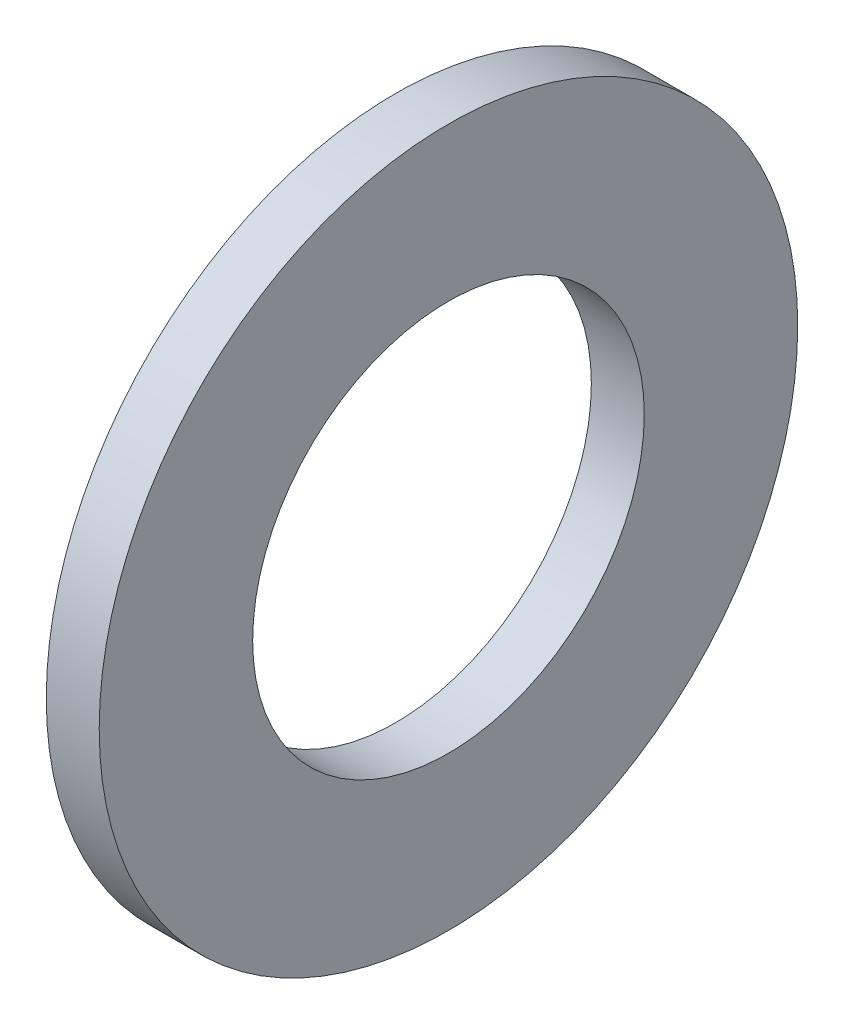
ISO-10303-21;
HEADER;
FILE_DESCRIPTION(('STEP AP214'),'2;1');
FILE_NAME('part.step','',(''),(''),'','','');
FILE_SCHEMA(('AUTOMOTIVE_DESIGN { 1 0 10303 214 1 1 1 1 }'));
ENDSEC;
DATA;
#1=APPLICATION_CONTEXT('core data for automotive mechanical design processes');
#2=APPLICATION_PROTOCOL_DEFINITION('international standard','automotive_design',2000,#1);
#3=PRODUCT_CONTEXT('',#1,'mechanical');
#4=PRODUCT('Part','Part','',(#3));
#5=PRODUCT_RELATED_PRODUCT_CATEGORY('part','',(#4));
#6=PRODUCT_DEFINITION_FORMATION('','',#4);
#7=PRODUCT_DEFINITION_CONTEXT('part definition',#1,'design');
#8=PRODUCT_DEFINITION('design','',#6,#7);
#9=PRODUCT_DEFINITION_SHAPE('','',#8);
#10=(LENGTH_UNIT() NAMED_UNIT(*) SI_UNIT(.MILLI.,.METRE.));
#11=(NAMED_UNIT(*) PLANE_ANGLE_UNIT() SI_UNIT($,.RADIAN.));
#12=(NAMED_UNIT(*) SI_UNIT($,.STERADIAN.) SOLID_ANGLE_UNIT());
#13=UNCERTAINTY_MEASURE_WITH_UNIT(LENGTH_MEASURE(1.E-05),#10,'distance_accuracy_value','');
#14=(GEOMETRIC_REPRESENTATION_CONTEXT(3) GLOBAL_UNCERTAINTY_ASSIGNED_CONTEXT((#13)) GLOBAL_UNIT_ASSIGNED_CONTEXT((#10,
#11,#12)) REPRESENTATION_CONTEXT('',''));
#15=CARTESIAN_POINT('',(0.,0.,0.));
#16=DIRECTION('',(0.,0.,1.));
#17=DIRECTION('',(1.,0.,0.));
#18=AXIS2_PLACEMENT_3D('',#15,#16,#17);
#19=CARTESIAN_POINT('',(-34.9249999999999,0.,0.));
#20=DIRECTION('',(-1.,0.,0.));
#21=DIRECTION('',(0.,0.,1.));
#22=AXIS2_PLACEMENT_3D('',#19,#20,#21);
#23=CYLINDRICAL_SURFACE('',#22,18.5);
#24=CARTESIAN_POINT('',(0.,0.,0.));
#25=DIRECTION('',(-1.,0.,0.));
#26=DIRECTION('',(0.,0.,1.));
#27=AXIS2_PLACEMENT_3D('',#24,#25,#26);
#28=CIRCLE('',#27,18.5);
#29=CARTESIAN_POINT('',(0.,0.,18.5));
#30=VERTEX_POINT('',#29);
#31=EDGE_CURVE('E10',#30,#30,#28,.T.);
#32=ORIENTED_EDGE('',*,*,#31,.F.);
#33=EDGE_LOOP('',(#32));
#34=FACE_BOUND('',#33,.T.);
#35=CARTESIAN_POINT('',(-5.,0.,0.));
#36=DIRECTION('',(-1.,0.,0.));
#37=DIRECTION('',(0.,0.,1.));
#38=AXIS2_PLACEMENT_3D('',#35,#36,#37);
#39=CIRCLE('',#38,18.5);
#40=CARTESIAN_POINT('',(-5.,0.,18.5));
#41=VERTEX_POINT('',#40);
#42=EDGE_CURVE('E44',#41,#41,#39,.T.);
#43=ORIENTED_EDGE('',*,*,#42,.T.);
#44=EDGE_LOOP('',(#43));
#45=FACE_BOUND('',#44,.T.);
#46=ADVANCED_FACE('F30',(#34,#45),#23,.F.);
#47=CARTESIAN_POINT('',(0.,18.5,0.));
#48=DIRECTION('',(-1.,0.,0.));
#49=DIRECTION('',(0.,0.,1.));
#50=AXIS2_PLACEMENT_3D('',#47,#48,#49);
#51=PLANE('',#50);
#52=CARTESIAN_POINT('',(0.,0.,0.));
#53=DIRECTION('',(-1.,0.,0.));
#54=DIRECTION('',(0.,0.,1.));
#55=AXIS2_PLACEMENT_3D('',#52,#53,#54);
#56=CIRCLE('',#55,33.);
#57=CARTESIAN_POINT('',(0.,0.,33.));
#58=VERTEX_POINT('',#57);
#59=EDGE_CURVE('E36',#58,#58,#56,.T.);
#60=ORIENTED_EDGE('',*,*,#59,.F.);
#61=EDGE_LOOP('',(#60));
#62=FACE_BOUND('',#61,.T.);
#63=ORIENTED_EDGE('',*,*,#31,.T.);
#64=EDGE_LOOP('',(#63));
#65=FACE_BOUND('',#64,.T.);
#66=ADVANCED_FACE('F59',(#62,#65),#51,.F.);
#67=CARTESIAN_POINT('',(-34.9249999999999,0.,0.));
#68=DIRECTION('',(-1.,0.,0.));
#69=DIRECTION('',(0.,0.,1.));
#70=AXIS2_PLACEMENT_3D('',#67,#68,#69);
#71=CYLINDRICAL_SURFACE('',#70,33.);
#72=CARTESIAN_POINT('',(-5.,0.,0.));
#73=DIRECTION('',(-1.,0.,0.));
#74=DIRECTION('',(0.,0.,1.));
#75=AXIS2_PLACEMENT_3D('',#72,#73,#74);
#76=CIRCLE('',#75,33.);
#77=CARTESIAN_POINT('',(-5.,0.,33.));
#78=VERTEX_POINT('',#77);
#79=EDGE_CURVE('E40',#78,#78,#76,.T.);
#80=ORIENTED_EDGE('',*,*,#79,.F.);
#81=EDGE_LOOP('',(#80));
#82=FACE_BOUND('',#81,.T.);
#83=ORIENTED_EDGE('',*,*,#59,.T.);
#84=EDGE_LOOP('',(#83));
#85=FACE_BOUND('',#84,.T.);
#86=ADVANCED_FACE('F54',(#82,#85),#71,.T.);
#87=CARTESIAN_POINT('',(-5.,33.,0.));
#88=DIRECTION('',(1.,0.,0.));
#89=DIRECTION('',(0.,0.,-1.));
#90=AXIS2_PLACEMENT_3D('',#87,#88,#89);
#91=PLANE('',#90);
#92=ORIENTED_EDGE('',*,*,#42,.F.);
#93=EDGE_LOOP('',(#92));
#94=FACE_BOUND('',#93,.T.);
#95=ORIENTED_EDGE('',*,*,#79,.T.);
#96=EDGE_LOOP('',(#95));
#97=FACE_BOUND('',#96,.T.);
#98=ADVANCED_FACE('F51',(#94,#97),#91,.F.);
#99=CLOSED_SHELL('',(#46,#66,#86,#98));
#100=MANIFOLD_SOLID_BREP('B2',#99);
#101=ADVANCED_BREP_SHAPE_REPRESENTATION('',(#18,#100),#14);
#102=SHAPE_DEFINITION_REPRESENTATION(#9,#101);
ENDSEC;
END-ISO-10303-21;
